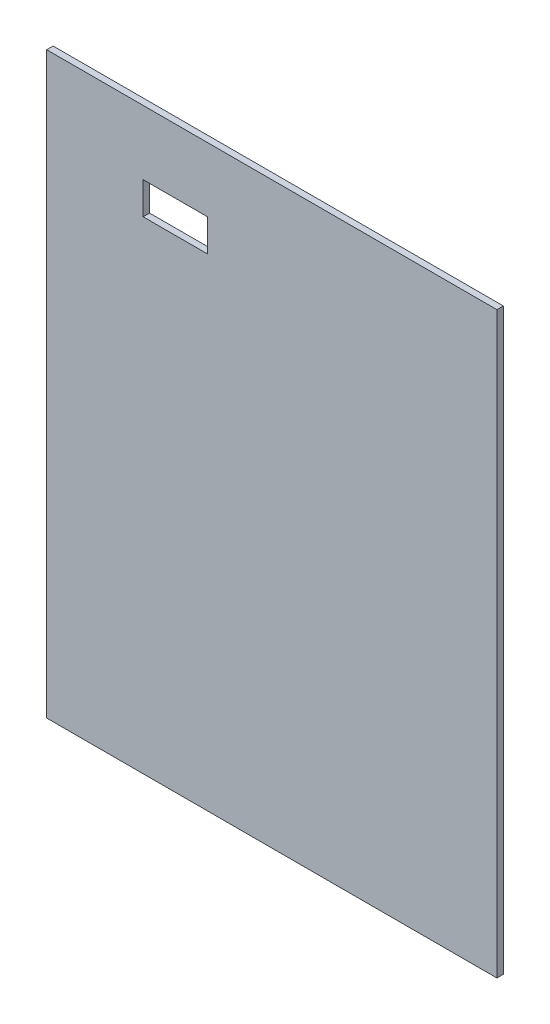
ISO-10303-21;
HEADER;
FILE_DESCRIPTION(('STEP AP214'),'2;1');
FILE_NAME('part.step','',(''),(''),'','','');
FILE_SCHEMA(('AUTOMOTIVE_DESIGN { 1 0 10303 214 1 1 1 1 }'));
ENDSEC;
DATA;
#1=APPLICATION_CONTEXT('core data for automotive mechanical design processes');
#2=APPLICATION_PROTOCOL_DEFINITION('international standard','automotive_design',2000,#1);
#3=PRODUCT_CONTEXT('',#1,'mechanical');
#4=PRODUCT('Part','Part','',(#3));
#5=PRODUCT_RELATED_PRODUCT_CATEGORY('part','',(#4));
#6=PRODUCT_DEFINITION_FORMATION('','',#4);
#7=PRODUCT_DEFINITION_CONTEXT('part definition',#1,'design');
#8=PRODUCT_DEFINITION('design','',#6,#7);
#9=PRODUCT_DEFINITION_SHAPE('','',#8);
#10=(LENGTH_UNIT() NAMED_UNIT(*) SI_UNIT(.MILLI.,.METRE.));
#11=(NAMED_UNIT(*) PLANE_ANGLE_UNIT() SI_UNIT($,.RADIAN.));
#12=(NAMED_UNIT(*) SI_UNIT($,.STERADIAN.) SOLID_ANGLE_UNIT());
#13=UNCERTAINTY_MEASURE_WITH_UNIT(LENGTH_MEASURE(1.E-05),#10,'distance_accuracy_value','');
#14=(GEOMETRIC_REPRESENTATION_CONTEXT(3) GLOBAL_UNCERTAINTY_ASSIGNED_CONTEXT((#13)) GLOBAL_UNIT_ASSIGNED_CONTEXT((#10,
#11,#12)) REPRESENTATION_CONTEXT('',''));
#15=CARTESIAN_POINT('',(0.,0.,0.));
#16=DIRECTION('',(0.,0.,1.));
#17=DIRECTION('',(1.,0.,0.));
#18=AXIS2_PLACEMENT_3D('',#15,#16,#17);
#19=CARTESIAN_POINT('',(0.,0.,5.));
#20=DIRECTION('',(1.,0.,0.));
#21=DIRECTION('',(0.,0.,-1.));
#22=AXIS2_PLACEMENT_3D('',#19,#20,#21);
#23=PLANE('',#22);
#24=DIRECTION('',(0.,-1.,0.));
#25=VECTOR('',#24,1.);
#26=CARTESIAN_POINT('',(0.,0.,0.));
#27=LINE('',#26,#25);
#28=CARTESIAN_POINT('',(0.,450.,0.));
#29=VERTEX_POINT('',#28);
#30=CARTESIAN_POINT('',(0.,0.,0.));
#31=VERTEX_POINT('',#30);
#32=EDGE_CURVE('E131',#29,#31,#27,.T.);
#33=ORIENTED_EDGE('',*,*,#32,.T.);
#34=DIRECTION('',(0.,0.,-1.));
#35=VECTOR('',#34,1.);
#36=CARTESIAN_POINT('',(0.,0.,5.));
#37=LINE('',#36,#35);
#38=CARTESIAN_POINT('',(0.,0.,5.));
#39=VERTEX_POINT('',#38);
#40=EDGE_CURVE('E11',#39,#31,#37,.T.);
#41=ORIENTED_EDGE('',*,*,#40,.F.);
#42=DIRECTION('',(0.,-1.,0.));
#43=VECTOR('',#42,1.);
#44=CARTESIAN_POINT('',(0.,0.,5.));
#45=LINE('',#44,#43);
#46=CARTESIAN_POINT('',(0.,450.,5.));
#47=VERTEX_POINT('',#46);
#48=EDGE_CURVE('E135',#47,#39,#45,.T.);
#49=ORIENTED_EDGE('',*,*,#48,.F.);
#50=DIRECTION('',(0.,0.,-1.));
#51=VECTOR('',#50,1.);
#52=CARTESIAN_POINT('',(0.,450.,5.));
#53=LINE('',#52,#51);
#54=EDGE_CURVE('E145',#47,#29,#53,.T.);
#55=ORIENTED_EDGE('',*,*,#54,.T.);
#56=EDGE_LOOP('',(#33,#41,#49,#55));
#57=FACE_BOUND('',#56,.T.);
#58=ADVANCED_FACE('F34',(#57),#23,.F.);
#59=CARTESIAN_POINT('',(0.,0.,5.));
#60=DIRECTION('',(0.,1.,0.));
#61=DIRECTION('',(0.,0.,1.));
#62=AXIS2_PLACEMENT_3D('',#59,#60,#61);
#63=PLANE('',#62);
#64=DIRECTION('',(1.,0.,0.));
#65=VECTOR('',#64,1.);
#66=CARTESIAN_POINT('',(0.,0.,0.));
#67=LINE('',#66,#65);
#68=CARTESIAN_POINT('',(350.,0.,0.));
#69=VERTEX_POINT('',#68);
#70=EDGE_CURVE('E148',#31,#69,#67,.T.);
#71=ORIENTED_EDGE('',*,*,#70,.T.);
#72=DIRECTION('',(0.,0.,-1.));
#73=VECTOR('',#72,1.);
#74=CARTESIAN_POINT('',(350.,0.,5.));
#75=LINE('',#74,#73);
#76=CARTESIAN_POINT('',(350.,0.,5.));
#77=VERTEX_POINT('',#76);
#78=EDGE_CURVE('E41',#77,#69,#75,.T.);
#79=ORIENTED_EDGE('',*,*,#78,.F.);
#80=DIRECTION('',(1.,0.,0.));
#81=VECTOR('',#80,1.);
#82=CARTESIAN_POINT('',(0.,0.,5.));
#83=LINE('',#82,#81);
#84=EDGE_CURVE('E138',#39,#77,#83,.T.);
#85=ORIENTED_EDGE('',*,*,#84,.F.);
#86=ORIENTED_EDGE('',*,*,#40,.T.);
#87=EDGE_LOOP('',(#71,#79,#85,#86));
#88=FACE_BOUND('',#87,.T.);
#89=ADVANCED_FACE('F176',(#88),#63,.F.);
#90=CARTESIAN_POINT('',(350.,0.,5.));
#91=DIRECTION('',(-1.,0.,0.));
#92=DIRECTION('',(0.,0.,1.));
#93=AXIS2_PLACEMENT_3D('',#90,#91,#92);
#94=PLANE('',#93);
#95=DIRECTION('',(0.,1.,0.));
#96=VECTOR('',#95,1.);
#97=CARTESIAN_POINT('',(350.,0.,0.));
#98=LINE('',#97,#96);
#99=CARTESIAN_POINT('',(350.,450.,0.));
#100=VERTEX_POINT('',#99);
#101=EDGE_CURVE('E150',#69,#100,#98,.T.);
#102=ORIENTED_EDGE('',*,*,#101,.T.);
#103=DIRECTION('',(0.,0.,-1.));
#104=VECTOR('',#103,1.);
#105=CARTESIAN_POINT('',(350.,450.,5.));
#106=LINE('',#105,#104);
#107=CARTESIAN_POINT('',(350.,450.,5.));
#108=VERTEX_POINT('',#107);
#109=EDGE_CURVE('E155',#108,#100,#106,.T.);
#110=ORIENTED_EDGE('',*,*,#109,.F.);
#111=DIRECTION('',(0.,1.,0.));
#112=VECTOR('',#111,1.);
#113=CARTESIAN_POINT('',(350.,0.,5.));
#114=LINE('',#113,#112);
#115=EDGE_CURVE('E141',#77,#108,#114,.T.);
#116=ORIENTED_EDGE('',*,*,#115,.F.);
#117=ORIENTED_EDGE('',*,*,#78,.T.);
#118=EDGE_LOOP('',(#102,#110,#116,#117));
#119=FACE_BOUND('',#118,.T.);
#120=ADVANCED_FACE('F162',(#119),#94,.F.);
#121=CARTESIAN_POINT('',(0.,450.,5.));
#122=DIRECTION('',(0.,-1.,0.));
#123=DIRECTION('',(0.,0.,-1.));
#124=AXIS2_PLACEMENT_3D('',#121,#122,#123);
#125=PLANE('',#124);
#126=DIRECTION('',(-1.,0.,0.));
#127=VECTOR('',#126,1.);
#128=CARTESIAN_POINT('',(0.,450.,0.));
#129=LINE('',#128,#127);
#130=EDGE_CURVE('E139',#100,#29,#129,.T.);
#131=ORIENTED_EDGE('',*,*,#130,.T.);
#132=ORIENTED_EDGE('',*,*,#54,.F.);
#133=DIRECTION('',(-1.,0.,0.));
#134=VECTOR('',#133,1.);
#135=CARTESIAN_POINT('',(0.,450.,5.));
#136=LINE('',#135,#134);
#137=EDGE_CURVE('E143',#108,#47,#136,.T.);
#138=ORIENTED_EDGE('',*,*,#137,.F.);
#139=ORIENTED_EDGE('',*,*,#109,.T.);
#140=EDGE_LOOP('',(#131,#132,#138,#139));
#141=FACE_BOUND('',#140,.T.);
#142=ADVANCED_FACE('F169',(#141),#125,.F.);
#143=CARTESIAN_POINT('',(0.,0.,5.));
#144=DIRECTION('',(0.,0.,-1.));
#145=DIRECTION('',(-1.,0.,0.));
#146=AXIS2_PLACEMENT_3D('',#143,#144,#145);
#147=PLANE('',#146);
#148=DIRECTION('',(-1.,0.,0.));
#149=VECTOR('',#148,1.);
#150=CARTESIAN_POINT('',(75.,400.,5.));
#151=LINE('',#150,#149);
#152=CARTESIAN_POINT('',(125.,400.,5.));
#153=VERTEX_POINT('',#152);
#154=CARTESIAN_POINT('',(75.,400.,5.));
#155=VERTEX_POINT('',#154);
#156=EDGE_CURVE('E125',#153,#155,#151,.T.);
#157=ORIENTED_EDGE('',*,*,#156,.F.);
#158=DIRECTION('',(0.,1.,0.));
#159=VECTOR('',#158,1.);
#160=CARTESIAN_POINT('',(125.,375.,5.));
#161=LINE('',#160,#159);
#162=CARTESIAN_POINT('',(125.,375.,5.));
#163=VERTEX_POINT('',#162);
#164=EDGE_CURVE('E48',#163,#153,#161,.T.);
#165=ORIENTED_EDGE('',*,*,#164,.F.);
#166=DIRECTION('',(1.,0.,0.));
#167=VECTOR('',#166,1.);
#168=CARTESIAN_POINT('',(75.,375.,5.));
#169=LINE('',#168,#167);
#170=CARTESIAN_POINT('',(75.,375.,5.));
#171=VERTEX_POINT('',#170);
#172=EDGE_CURVE('E116',#171,#163,#169,.T.);
#173=ORIENTED_EDGE('',*,*,#172,.F.);
#174=DIRECTION('',(0.,-1.,0.));
#175=VECTOR('',#174,1.);
#176=CARTESIAN_POINT('',(75.,375.,5.));
#177=LINE('',#176,#175);
#178=EDGE_CURVE('E119',#155,#171,#177,.T.);
#179=ORIENTED_EDGE('',*,*,#178,.F.);
#180=EDGE_LOOP('',(#157,#165,#173,#179));
#181=FACE_BOUND('',#180,.T.);
#182=ORIENTED_EDGE('',*,*,#48,.T.);
#183=ORIENTED_EDGE('',*,*,#84,.T.);
#184=ORIENTED_EDGE('',*,*,#115,.T.);
#185=ORIENTED_EDGE('',*,*,#137,.T.);
#186=EDGE_LOOP('',(#182,#183,#184,#185));
#187=FACE_BOUND('',#186,.T.);
#188=ADVANCED_FACE('F175',(#181,#187),#147,.F.);
#189=CARTESIAN_POINT('',(0.,0.,0.));
#190=DIRECTION('',(0.,0.,-1.));
#191=DIRECTION('',(-1.,0.,0.));
#192=AXIS2_PLACEMENT_3D('',#189,#190,#191);
#193=PLANE('',#192);
#194=DIRECTION('',(0.,1.,0.));
#195=VECTOR('',#194,1.);
#196=CARTESIAN_POINT('',(125.,375.,0.));
#197=LINE('',#196,#195);
#198=CARTESIAN_POINT('',(125.,375.,0.));
#199=VERTEX_POINT('',#198);
#200=CARTESIAN_POINT('',(125.,400.,0.));
#201=VERTEX_POINT('',#200);
#202=EDGE_CURVE('E100',#199,#201,#197,.T.);
#203=ORIENTED_EDGE('',*,*,#202,.T.);
#204=DIRECTION('',(-1.,0.,0.));
#205=VECTOR('',#204,1.);
#206=CARTESIAN_POINT('',(75.,400.,0.));
#207=LINE('',#206,#205);
#208=CARTESIAN_POINT('',(75.,400.,0.));
#209=VERTEX_POINT('',#208);
#210=EDGE_CURVE('E109',#201,#209,#207,.T.);
#211=ORIENTED_EDGE('',*,*,#210,.T.);
#212=DIRECTION('',(0.,-1.,0.));
#213=VECTOR('',#212,1.);
#214=CARTESIAN_POINT('',(75.,375.,0.));
#215=LINE('',#214,#213);
#216=CARTESIAN_POINT('',(75.,375.,0.));
#217=VERTEX_POINT('',#216);
#218=EDGE_CURVE('E56',#209,#217,#215,.T.);
#219=ORIENTED_EDGE('',*,*,#218,.T.);
#220=DIRECTION('',(1.,0.,0.));
#221=VECTOR('',#220,1.);
#222=CARTESIAN_POINT('',(75.,375.,0.));
#223=LINE('',#222,#221);
#224=EDGE_CURVE('E106',#217,#199,#223,.T.);
#225=ORIENTED_EDGE('',*,*,#224,.T.);
#226=EDGE_LOOP('',(#203,#211,#219,#225));
#227=FACE_BOUND('',#226,.T.);
#228=ORIENTED_EDGE('',*,*,#32,.F.);
#229=ORIENTED_EDGE('',*,*,#130,.F.);
#230=ORIENTED_EDGE('',*,*,#101,.F.);
#231=ORIENTED_EDGE('',*,*,#70,.F.);
#232=EDGE_LOOP('',(#228,#229,#230,#231));
#233=FACE_BOUND('',#232,.T.);
#234=ADVANCED_FACE('F113',(#227,#233),#193,.T.);
#235=CARTESIAN_POINT('',(125.,375.,0.));
#236=DIRECTION('',(1.,0.,0.));
#237=DIRECTION('',(0.,0.,-1.));
#238=AXIS2_PLACEMENT_3D('',#235,#236,#237);
#239=PLANE('',#238);
#240=ORIENTED_EDGE('',*,*,#164,.T.);
#241=DIRECTION('',(0.,0.,1.));
#242=VECTOR('',#241,1.);
#243=CARTESIAN_POINT('',(125.,400.,0.));
#244=LINE('',#243,#242);
#245=EDGE_CURVE('E96',#201,#153,#244,.T.);
#246=ORIENTED_EDGE('',*,*,#245,.F.);
#247=ORIENTED_EDGE('',*,*,#202,.F.);
#248=DIRECTION('',(0.,0.,1.));
#249=VECTOR('',#248,1.);
#250=CARTESIAN_POINT('',(125.,375.,0.));
#251=LINE('',#250,#249);
#252=EDGE_CURVE('E129',#199,#163,#251,.T.);
#253=ORIENTED_EDGE('',*,*,#252,.T.);
#254=EDGE_LOOP('',(#240,#246,#247,#253));
#255=FACE_BOUND('',#254,.T.);
#256=ADVANCED_FACE('F98',(#255),#239,.F.);
#257=CARTESIAN_POINT('',(75.,375.,0.));
#258=DIRECTION('',(0.,-1.,0.));
#259=DIRECTION('',(0.,0.,-1.));
#260=AXIS2_PLACEMENT_3D('',#257,#258,#259);
#261=PLANE('',#260);
#262=ORIENTED_EDGE('',*,*,#172,.T.);
#263=ORIENTED_EDGE('',*,*,#252,.F.);
#264=ORIENTED_EDGE('',*,*,#224,.F.);
#265=DIRECTION('',(0.,0.,1.));
#266=VECTOR('',#265,1.);
#267=CARTESIAN_POINT('',(75.,375.,0.));
#268=LINE('',#267,#266);
#269=EDGE_CURVE('E132',#217,#171,#268,.T.);
#270=ORIENTED_EDGE('',*,*,#269,.T.);
#271=EDGE_LOOP('',(#262,#263,#264,#270));
#272=FACE_BOUND('',#271,.T.);
#273=ADVANCED_FACE('F193',(#272),#261,.F.);
#274=CARTESIAN_POINT('',(75.,375.,0.));
#275=DIRECTION('',(-1.,0.,0.));
#276=DIRECTION('',(0.,0.,1.));
#277=AXIS2_PLACEMENT_3D('',#274,#275,#276);
#278=PLANE('',#277);
#279=ORIENTED_EDGE('',*,*,#178,.T.);
#280=ORIENTED_EDGE('',*,*,#269,.F.);
#281=ORIENTED_EDGE('',*,*,#218,.F.);
#282=DIRECTION('',(0.,0.,1.));
#283=VECTOR('',#282,1.);
#284=CARTESIAN_POINT('',(75.,400.,0.));
#285=LINE('',#284,#283);
#286=EDGE_CURVE('E105',#209,#155,#285,.T.);
#287=ORIENTED_EDGE('',*,*,#286,.T.);
#288=EDGE_LOOP('',(#279,#280,#281,#287));
#289=FACE_BOUND('',#288,.T.);
#290=ADVANCED_FACE('F196',(#289),#278,.F.);
#291=CARTESIAN_POINT('',(75.,400.,0.));
#292=DIRECTION('',(0.,1.,0.));
#293=DIRECTION('',(0.,0.,1.));
#294=AXIS2_PLACEMENT_3D('',#291,#292,#293);
#295=PLANE('',#294);
#296=ORIENTED_EDGE('',*,*,#156,.T.);
#297=ORIENTED_EDGE('',*,*,#286,.F.);
#298=ORIENTED_EDGE('',*,*,#210,.F.);
#299=ORIENTED_EDGE('',*,*,#245,.T.);
#300=EDGE_LOOP('',(#296,#297,#298,#299));
#301=FACE_BOUND('',#300,.T.);
#302=ADVANCED_FACE('F110',(#301),#295,.F.);
#303=CLOSED_SHELL('',(#58,#89,#120,#142,#188,#234,#256,#273,#290,#302));
#304=MANIFOLD_SOLID_BREP('B2',#303);
#305=ADVANCED_BREP_SHAPE_REPRESENTATION('',(#18,#304),#14);
#306=SHAPE_DEFINITION_REPRESENTATION(#9,#305);
ENDSEC;
END-ISO-10303-21;
